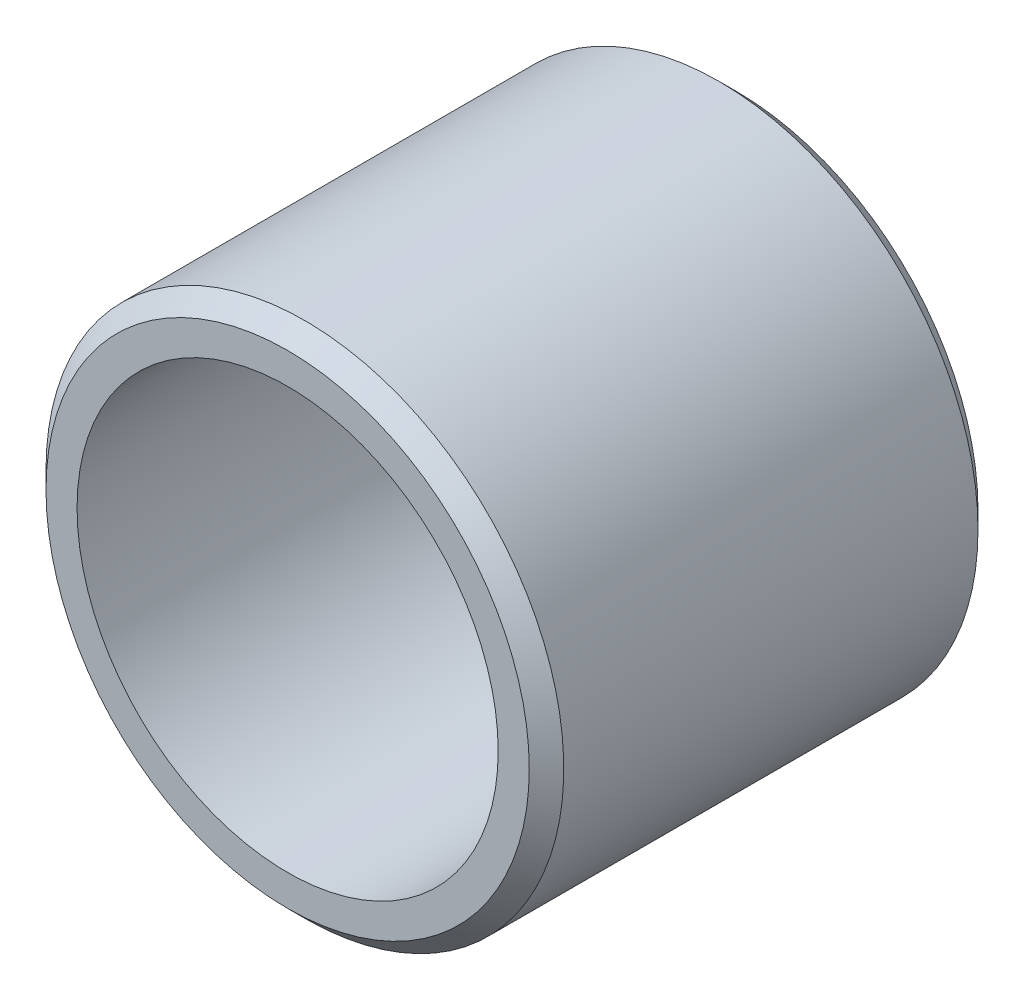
from build123d import *

# Parameters (mm, degrees)
SKETCH2_R           = 7.5
SKETCH2_R_2         = 6.1
BOSS_EXTRUDE1_DEPTH = 13
CHAMFER1_SIZE       = 0.5


with BuildPart() as part:
    # Sketch2 → Boss-Extrude1 (new body)
    with BuildSketch(Plane.XY):
        with Locations(Location((0, 0, 0), (0, 0, 180))):
            Circle(SKETCH2_R)
        with Locations(Location((0, 0, 0), (0, 0, 180))):
            Circle(SKETCH2_R_2, mode=Mode.SUBTRACT)
    extrude(amount=BOSS_EXTRUDE1_DEPTH)

    # Chamfer1
    chamfer1_edges = [part.edges().sort_by_distance(p)[0] for p in [
        (7.5, 0, 0),
        (7.5, 0, 13),
    ]]
    chamfer(chamfer1_edges, length=CHAMFER1_SIZE)


solid = part.part
